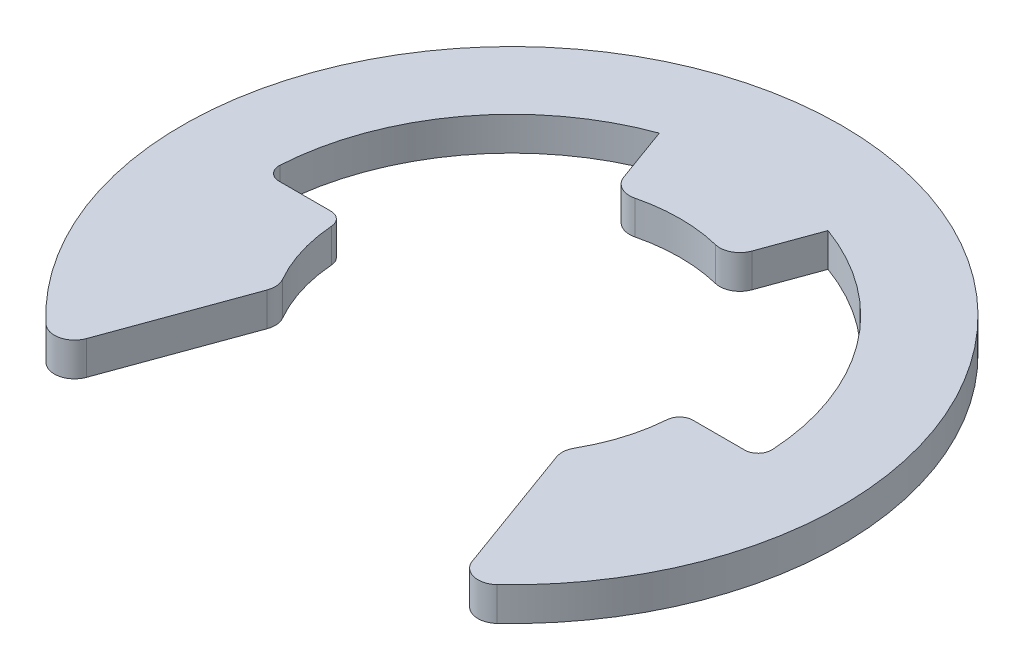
from build123d import *

# Parameters (mm, degrees)
BOSS_EXTRUDE1_DEPTH = 0.75
FILLET1_R           = 0.9
FILLET2_R           = 0.6


with BuildPart() as part:
    # Sketch2 → Boss-Extrude1 (new, symmetric)
    with BuildSketch(Plane(origin=(0, 0, 0), x_dir=(1, 0, 0), z_dir=(0, 1, 0))):
        with BuildLine():
            Line((-9.044462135, -11.58825719), (-6.305, -4.061646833))
            ThreePointArc((-6.305, -4.061646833), (-7.195050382, -2.116896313), (-7.5, 0))
            Line((-7.5, 0), (-11, 0))
            ThreePointArc((-11, 0), (-9.010672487, 6.3093408), (-3.762221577, 10.336618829))
            Line((-3.762221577, 10.336618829), (-2.565151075, 7.047694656))
            ThreePointArc((-2.565151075, 7.047694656), (0, 7.5), (2.565151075, 7.047694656))
            Line((2.565151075, 7.047694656), (3.762221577, 10.336618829))
            ThreePointArc((3.762221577, 10.336618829), (9.010672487, 6.3093408), (11, 0))
            Line((11, 0), (7.5, 0))
            ThreePointArc((7.5, 0), (7.195050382, -2.116896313), (6.305, -4.061646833))
            Line((6.305, -4.061646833), (9.044462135, -11.58825719))
            ThreePointArc((9.044462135, -11.58825719), (0, 14.7), (-9.044462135, -11.58825719))
        make_face()
    extrude(amount=BOSS_EXTRUDE1_DEPTH, both=True)

    # Fillet1
    fillet1_edges = [part.edges().sort_by_distance(p)[0] for p in [
        (-6.305, 0, 4.061646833),
        (-9.044462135, 0, 11.58825719),
        (9.044462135, 0, 11.58825719),
        (6.305, 0, 4.061646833),
        (2.565151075, 0, -7.047694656),
        (-2.565151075, 0, -7.047694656),
    ]]
    fillet(fillet1_edges, radius=FILLET1_R)

    # Fillet2
    fillet2_edges = [part.edges().sort_by_distance(p)[0] for p in [
        (-11, 0, 0),
        (-7.5, 0, 0),
        (7.5, 0, 0),
        (11, 0, 0),
    ]]
    fillet(fillet2_edges, radius=FILLET2_R)


solid = part.part
